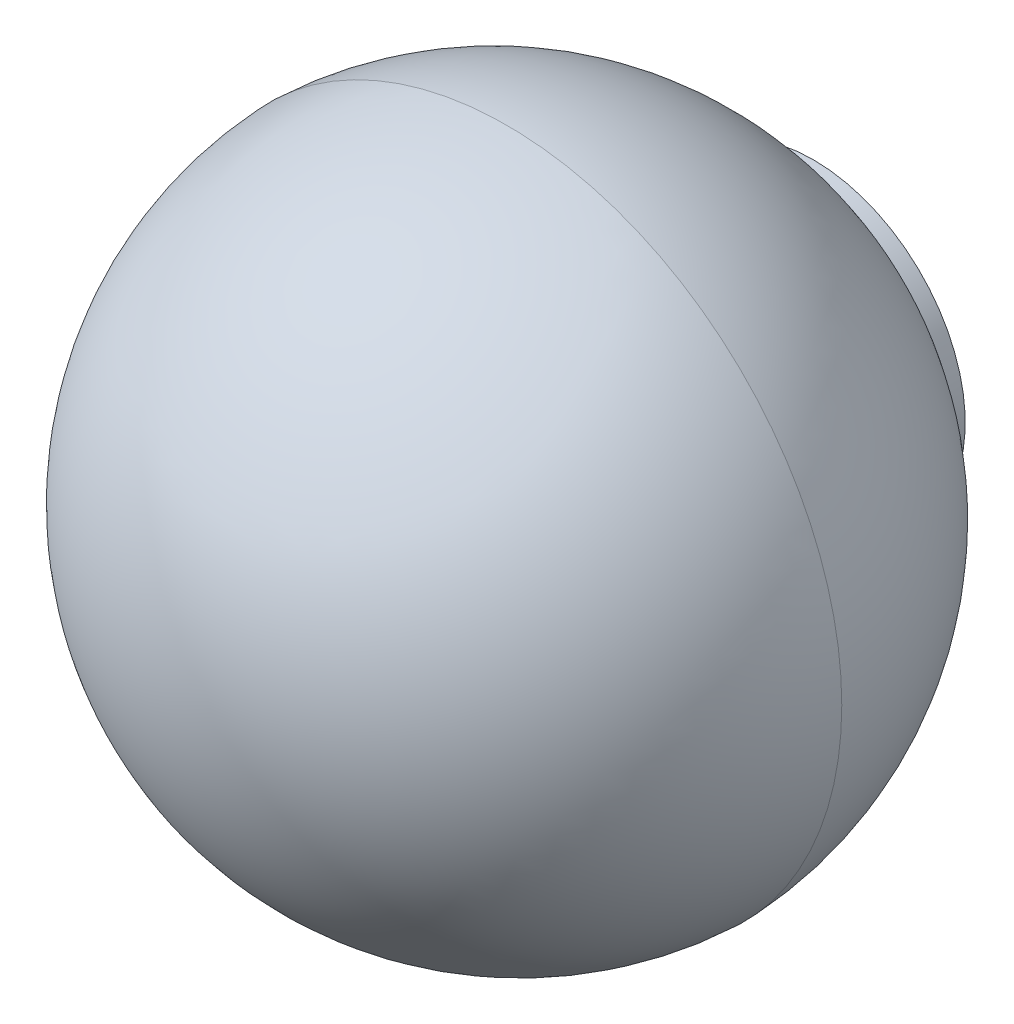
ISO-10303-21;
HEADER;
FILE_DESCRIPTION(('STEP AP214'),'2;1');
FILE_NAME('part.step','',(''),(''),'','','');
FILE_SCHEMA(('AUTOMOTIVE_DESIGN { 1 0 10303 214 1 1 1 1 }'));
ENDSEC;
DATA;
#1=APPLICATION_CONTEXT('core data for automotive mechanical design processes');
#2=APPLICATION_PROTOCOL_DEFINITION('international standard','automotive_design',2000,#1);
#3=PRODUCT_CONTEXT('',#1,'mechanical');
#4=PRODUCT('Part','Part','',(#3));
#5=PRODUCT_RELATED_PRODUCT_CATEGORY('part','',(#4));
#6=PRODUCT_DEFINITION_FORMATION('','',#4);
#7=PRODUCT_DEFINITION_CONTEXT('part definition',#1,'design');
#8=PRODUCT_DEFINITION('design','',#6,#7);
#9=PRODUCT_DEFINITION_SHAPE('','',#8);
#10=(LENGTH_UNIT() NAMED_UNIT(*) SI_UNIT(.MILLI.,.METRE.));
#11=(NAMED_UNIT(*) PLANE_ANGLE_UNIT() SI_UNIT($,.RADIAN.));
#12=(NAMED_UNIT(*) SI_UNIT($,.STERADIAN.) SOLID_ANGLE_UNIT());
#13=UNCERTAINTY_MEASURE_WITH_UNIT(LENGTH_MEASURE(1.E-05),#10,'distance_accuracy_value','');
#14=(GEOMETRIC_REPRESENTATION_CONTEXT(3) GLOBAL_UNCERTAINTY_ASSIGNED_CONTEXT((#13)) GLOBAL_UNIT_ASSIGNED_CONTEXT((#10,
#11,#12)) REPRESENTATION_CONTEXT('',''));
#15=CARTESIAN_POINT('',(0.,0.,0.));
#16=DIRECTION('',(0.,0.,1.));
#17=DIRECTION('',(1.,0.,0.));
#18=AXIS2_PLACEMENT_3D('',#15,#16,#17);
#19=CARTESIAN_POINT('',(0.,0.,14.));
#20=DIRECTION('',(0.,0.,-1.));
#21=DIRECTION('',(1.,0.,0.));
#22=AXIS2_PLACEMENT_3D('',#19,#20,#21);
#23=SPHERICAL_SURFACE('',#22,16.);
#24=CARTESIAN_POINT('',(0.,0.,14.631575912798));
#25=DIRECTION('',(0.,0.,-1.));
#26=DIRECTION('',(0.,1.,0.));
#27=AXIS2_PLACEMENT_3D('',#24,#25,#26);
#28=CIRCLE('',#27,15.9875298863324);
#29=CARTESIAN_POINT('',(15.9875298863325,0.,14.631575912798));
#30=VERTEX_POINT('',#29);
#31=EDGE_CURVE('E22',#30,#30,#28,.T.);
#32=ORIENTED_EDGE('',*,*,#31,.F.);
#33=EDGE_LOOP('',(#32));
#34=FACE_BOUND('',#33,.T.);
#35=ADVANCED_FACE('F12',(#34),#23,.T.);
#36=CARTESIAN_POINT('',(0.,0.,0.));
#37=DIRECTION('',(0.,0.,-1.));
#38=DIRECTION('',(0.,1.,0.));
#39=AXIS2_PLACEMENT_3D('',#36,#37,#38);
#40=PLANE('',#39);
#41=CARTESIAN_POINT('',(0.,0.,0.));
#42=DIRECTION('',(0.,0.,-1.));
#43=DIRECTION('',(0.,1.,0.));
#44=AXIS2_PLACEMENT_3D('',#41,#42,#43);
#45=CIRCLE('',#44,5.);
#46=CARTESIAN_POINT('',(0.,5.,0.));
#47=VERTEX_POINT('',#46);
#48=EDGE_CURVE('E31',#47,#47,#45,.T.);
#49=ORIENTED_EDGE('',*,*,#48,.F.);
#50=EDGE_LOOP('',(#49));
#51=FACE_BOUND('',#50,.T.);
#52=CARTESIAN_POINT('',(0.,0.,0.));
#53=DIRECTION('',(0.,0.,-1.));
#54=DIRECTION('',(0.,1.,0.));
#55=AXIS2_PLACEMENT_3D('',#52,#53,#54);
#56=CIRCLE('',#55,7.25);
#57=CARTESIAN_POINT('',(0.,7.25,0.));
#58=VERTEX_POINT('',#57);
#59=EDGE_CURVE('E8',#58,#58,#56,.T.);
#60=ORIENTED_EDGE('',*,*,#59,.T.);
#61=EDGE_LOOP('',(#60));
#62=FACE_BOUND('',#61,.T.);
#63=ADVANCED_FACE('F37',(#51,#62),#40,.T.);
#64=CARTESIAN_POINT('',(0.,0.,0.));
#65=DIRECTION('',(0.,0.,-1.));
#66=DIRECTION('',(0.,1.,0.));
#67=AXIS2_PLACEMENT_3D('',#64,#65,#66);
#68=CYLINDRICAL_SURFACE('',#67,7.25);
#69=CARTESIAN_POINT('',(0.,0.,1.));
#70=DIRECTION('',(0.,0.,-1.));
#71=DIRECTION('',(0.,1.,0.));
#72=AXIS2_PLACEMENT_3D('',#69,#70,#71);
#73=CIRCLE('',#72,7.25);
#74=CARTESIAN_POINT('',(7.25000000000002,0.,0.999999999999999));
#75=VERTEX_POINT('',#74);
#76=EDGE_CURVE('E18',#75,#75,#73,.T.);
#77=ORIENTED_EDGE('',*,*,#76,.T.);
#78=EDGE_LOOP('',(#77));
#79=FACE_BOUND('',#78,.T.);
#80=ORIENTED_EDGE('',*,*,#59,.F.);
#81=EDGE_LOOP('',(#80));
#82=FACE_BOUND('',#81,.T.);
#83=ADVANCED_FACE('F39',(#79,#82),#68,.T.);
#84=CARTESIAN_POINT('',(0.,0.,15.2631518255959));
#85=DIRECTION('',(0.,0.,-1.));
#86=DIRECTION('',(1.,0.,0.));
#87=AXIS2_PLACEMENT_3D('',#84,#85,#86);
#88=SPHERICAL_SURFACE('',#87,16.);
#89=CARTESIAN_POINT('',(15.9875298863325,0.,14.631575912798));
#90=CARTESIAN_POINT('',(15.9805505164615,0.,14.4548728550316));
#91=CARTESIAN_POINT('',(15.9706393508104,0.,14.2782856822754));
#92=CARTESIAN_POINT('',(15.9449693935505,0.,13.9255368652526));
#93=CARTESIAN_POINT('',(15.9292106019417,0.,13.7493752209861));
#94=CARTESIAN_POINT('',(15.8918613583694,0.,13.3976712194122));
#95=CARTESIAN_POINT('',(15.8702709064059,0.,13.2221288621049));
#96=CARTESIAN_POINT('',(15.8212824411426,0.,12.871856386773));
#97=CARTESIAN_POINT('',(15.7938844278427,0.,12.6971262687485));
#98=CARTESIAN_POINT('',(15.7333108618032,0.,12.3486703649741));
#99=CARTESIAN_POINT('',(15.7001353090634,0.,12.1749445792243));
#100=CARTESIAN_POINT('',(15.6280431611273,0.,11.8286883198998));
#101=CARTESIAN_POINT('',(15.5891265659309,0.,11.6561578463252));
#102=CARTESIAN_POINT('',(15.5055951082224,0.,11.3124818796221));
#103=CARTESIAN_POINT('',(15.4609802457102,0.,11.1413363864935));
#104=CARTESIAN_POINT('',(15.3661013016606,0.,10.8006185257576));
#105=CARTESIAN_POINT('',(15.3158372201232,0.,10.6310461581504));
#106=CARTESIAN_POINT('',(15.2097150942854,0.,10.293660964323));
#107=CARTESIAN_POINT('',(15.153857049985,0.,10.1258481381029));
#108=CARTESIAN_POINT('',(15.0366084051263,0.,9.79216650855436));
#109=CARTESIAN_POINT('',(14.9752178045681,0.,9.62629770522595));
#110=CARTESIAN_POINT('',(14.8469715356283,0.,9.29668646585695));
#111=CARTESIAN_POINT('',(14.7801158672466,0.,9.13294402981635));
#112=CARTESIAN_POINT('',(14.6410129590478,0.,8.80776553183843));
#113=CARTESIAN_POINT('',(14.5687657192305,0.,8.64632946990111));
#114=CARTESIAN_POINT('',(14.4189590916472,0.,8.32594119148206));
#115=CARTESIAN_POINT('',(14.3413997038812,0.,8.16698897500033));
#116=CARTESIAN_POINT('',(14.1810540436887,0.,7.85174312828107));
#117=CARTESIAN_POINT('',(14.0982677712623,0.,7.69544949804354));
#118=CARTESIAN_POINT('',(13.9275593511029,0.,7.38569264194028));
#119=CARTESIAN_POINT('',(13.83963720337,0.,7.23222941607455));
#120=CARTESIAN_POINT('',(13.6587536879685,0.,6.92830207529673));
#121=CARTESIAN_POINT('',(13.5657923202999,0.,6.77783796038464));
#122=CARTESIAN_POINT('',(13.3749325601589,0.,6.48007425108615));
#123=CARTESIAN_POINT('',(13.2770341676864,0.,6.33277465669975));
#124=CARTESIAN_POINT('',(13.0764079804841,0.,6.04150191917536));
#125=CARTESIAN_POINT('',(12.9736801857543,0.,5.89752877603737));
#126=CARTESIAN_POINT('',(12.7635081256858,0.,5.61306721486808));
#127=CARTESIAN_POINT('',(12.6560638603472,0.,5.47257879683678));
#128=CARTESIAN_POINT('',(12.4365769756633,0.,5.19524112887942));
#129=CARTESIAN_POINT('',(12.3245343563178,0.,5.05839187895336));
#130=CARTESIAN_POINT('',(12.0959739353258,0.,4.78848298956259));
#131=CARTESIAN_POINT('',(11.9794561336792,0.,4.65542335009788));
#132=CARTESIAN_POINT('',(11.7420734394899,0.,4.39323995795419));
#133=CARTESIAN_POINT('',(11.6212085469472,0.,4.26411620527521));
#134=CARTESIAN_POINT('',(11.3752645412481,0.,4.00994653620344));
#135=CARTESIAN_POINT('',(11.2501854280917,0.,3.88490061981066));
#136=CARTESIAN_POINT('',(10.995950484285,0.,3.63902408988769));
#137=CARTESIAN_POINT('',(10.8667946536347,0.,3.5181934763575));
#138=CARTESIAN_POINT('',(10.6045482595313,0.,3.28088038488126));
#139=CARTESIAN_POINT('',(10.4714576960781,0.,3.16439790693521));
#140=CARTESIAN_POINT('',(10.2014881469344,0.,2.93590913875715));
#141=CARTESIAN_POINT('',(10.0646091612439,0.,2.82390284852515));
#142=CARTESIAN_POINT('',(9.7872132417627,0.,2.60448958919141));
#143=CARTESIAN_POINT('',(9.64669630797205,0.,2.49708262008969));
#144=CARTESIAN_POINT('',(9.36217897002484,0.,2.28698607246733));
#145=CARTESIAN_POINT('',(9.21817856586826,0.,2.18429649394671));
#146=CARTESIAN_POINT('',(8.92685257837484,0.,1.98374764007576));
#147=CARTESIAN_POINT('',(8.779526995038,0.,1.88588836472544));
#148=CARTESIAN_POINT('',(8.48171265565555,0.,1.69510761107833));
#149=CARTESIAN_POINT('',(8.33122389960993,0.,1.60218613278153));
#150=CARTESIAN_POINT('',(8.02724847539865,0.,1.42138344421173));
#151=CARTESIAN_POINT('',(7.87376180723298,0.,1.33350223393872));
#152=CARTESIAN_POINT('',(7.56395994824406,0.,1.162875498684));
#153=CARTESIAN_POINT('',(7.40764475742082,0.,1.08012997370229));
#154=CARTESIAN_POINT('',(7.25000000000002,0.,0.999999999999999));
#155=B_SPLINE_CURVE_WITH_KNOTS('',3,(#89,#90,#91,#92,#93,#94,#95,#96,#97,#98,#99,#100,#101,#102,
#103,#104,#105,#106,#107,#108,#109,#110,#111,#112,#113,#114,#115,#116,#117,#118,#119,#120,#121,
#122,#123,#124,#125,#126,#127,#128,#129,#130,#131,#132,#133,#134,#135,#136,#137,#138,#139,#140,
#141,#142,#143,#144,#145,#146,#147,#148,#149,#150,#151,#152,#153,#154),.UNSPECIFIED.,.F.,.F.,(4,
2,2,2,2,2,2,2,2,2,2,2,2,2,2,2,2,2,2,2,2,2,2,2,2,2,2,2,2,2,2,2,4),(0.,0.530498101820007,
1.06099620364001,1.59149430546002,2.12199240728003,2.65249050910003,3.18298861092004,
3.71348671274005,4.24398481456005,4.77448291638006,5.30498101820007,5.83547912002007,
6.36597722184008,6.89647532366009,7.42697342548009,7.9574715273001,8.4879696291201,
9.01846773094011,9.54896583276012,10.0794639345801,10.6099620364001,11.1404601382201,
11.6709582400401,12.2014563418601,12.7319544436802,13.2624525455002,13.7929506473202,
14.3234487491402,14.8539468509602,15.3844449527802,15.9149430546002,16.4454411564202,
16.9759392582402),.UNSPECIFIED.);
#156=EDGE_CURVE('BSEAM46',#30,#75,#155,.T.);
#157=ORIENTED_EDGE('',*,*,#31,.T.);
#158=ORIENTED_EDGE('',*,*,#76,.F.);
#159=ORIENTED_EDGE('',*,*,#156,.T.);
#160=ORIENTED_EDGE('',*,*,#156,.F.);
#161=EDGE_LOOP('',(#157,#159,#158,#160));
#162=FACE_BOUND('',#161,.T.);
#163=ADVANCED_FACE('F46',(#162),#88,.T.);
#164=CARTESIAN_POINT('',(0.,0.,15.));
#165=DIRECTION('',(0.,0.,-1.));
#166=DIRECTION('',(0.,1.,0.));
#167=AXIS2_PLACEMENT_3D('',#164,#165,#166);
#168=CYLINDRICAL_SURFACE('',#167,5.);
#169=CARTESIAN_POINT('',(0.,0.,15.));
#170=DIRECTION('',(0.,0.,-1.));
#171=DIRECTION('',(0.,1.,0.));
#172=AXIS2_PLACEMENT_3D('',#169,#170,#171);
#173=CIRCLE('',#172,5.);
#174=CARTESIAN_POINT('',(0.,5.,15.));
#175=VERTEX_POINT('',#174);
#176=EDGE_CURVE('E26',#175,#175,#173,.T.);
#177=ORIENTED_EDGE('',*,*,#176,.F.);
#178=EDGE_LOOP('',(#177));
#179=FACE_BOUND('',#178,.T.);
#180=ORIENTED_EDGE('',*,*,#48,.T.);
#181=EDGE_LOOP('',(#180));
#182=FACE_BOUND('',#181,.T.);
#183=ADVANCED_FACE('F35',(#179,#182),#168,.F.);
#184=CARTESIAN_POINT('',(0.,0.,15.));
#185=DIRECTION('',(0.,0.,-1.));
#186=DIRECTION('',(0.,1.,0.));
#187=AXIS2_PLACEMENT_3D('',#184,#185,#186);
#188=PLANE('',#187);
#189=ORIENTED_EDGE('',*,*,#176,.T.);
#190=EDGE_LOOP('',(#189));
#191=FACE_BOUND('',#190,.T.);
#192=ADVANCED_FACE('F55',(#191),#188,.T.);
#193=CLOSED_SHELL('',(#35,#63,#83,#163,#183,#192));
#194=MANIFOLD_SOLID_BREP('B1',#193);
#195=ADVANCED_BREP_SHAPE_REPRESENTATION('',(#18,#194),#14);
#196=SHAPE_DEFINITION_REPRESENTATION(#9,#195);
ENDSEC;
END-ISO-10303-21;
